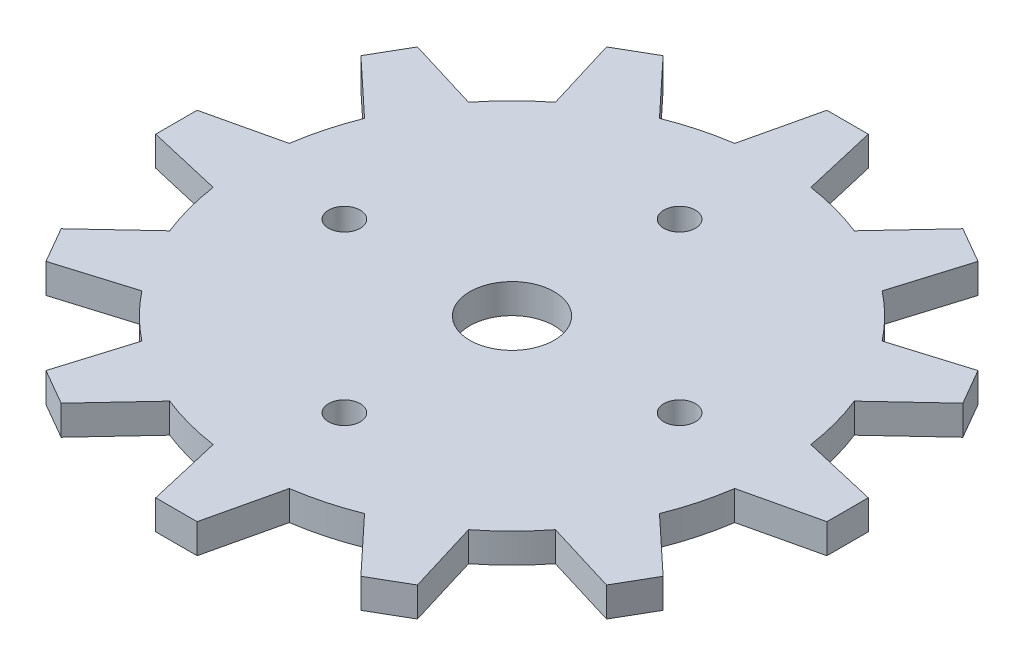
from build123d import *

# Parameters (mm, degrees)
SKETCH2_R           = 25
BOSS_EXTRUDE1_DEPTH = 2.8
BOSS_EXTRUDE4_DEPTH = 2.8
CIRPATTERN1_COUNT   = 12
SKETCH8_R           = 4
SKETCH8_R_2         = 1.5
CUT_EXTRUDE1_DEPTH  = 10


with BuildPart() as part:
    # Sketch2 → Boss-Extrude1 (new body)
    with BuildSketch(Plane(origin=(0, 0, 0), x_dir=(1, 0, 0), z_dir=(0, 1, 0))):
        with Locations(Location((0, 0, 0), (0, 0, 270))):
            Circle(SKETCH2_R)
    boss_extrude1 = extrude(amount=BOSS_EXTRUDE1_DEPTH)

    # Sketch7 → Boss-Extrude4 (add)
    with BuildSketch(Plane(origin=(0, 2.8, 0), x_dir=(1, 0, 0), z_dir=(0, 1, 0))):
        Polygon((-23.06973929, 4), (-23.06973929, -4), (-31.836295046, -1.963458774), (-31.836295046, 1.963458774), align=None)
    boss_extrude4 = extrude(amount=-BOSS_EXTRUDE4_DEPTH)

    # CirPattern1: Boss-Extrude1, Boss-Extrude4 ×12 about axis
    cirpattern1_axis = Axis((0, 0, 0), (0, 1, 0))
    add([boss_extrude1.rotate(cirpattern1_axis, i * 360 / CIRPATTERN1_COUNT) for i in range(1, CIRPATTERN1_COUNT)])
    add([boss_extrude4.rotate(cirpattern1_axis, i * 360 / CIRPATTERN1_COUNT) for i in range(1, CIRPATTERN1_COUNT)])

    # Sketch8 → Cut-Extrude1 (cut)
    with BuildSketch(Plane(origin=(0, 2.8, 0), x_dir=(1, 0, 0), z_dir=(0, 1, 0))):
        with Locations(Location((0, 0, 0), (0, 0, 270))):
            Circle(SKETCH8_R)
        with Locations(Location((0, -15.9, 0), (0, 0, 270))):
            Circle(SKETCH8_R_2)
        with Locations(Location((-15.9, 0, 0), (0, 0, 270))):
            Circle(SKETCH8_R_2)
        with Locations(Location((0, 15.9, 0), (0, 0, 270))):
            Circle(SKETCH8_R_2)
        with Locations(Location((15.9, 0, 0), (0, 0, 270))):
            Circle(SKETCH8_R_2)
    extrude(amount=-CUT_EXTRUDE1_DEPTH, mode=Mode.SUBTRACT)


solid = part.part
